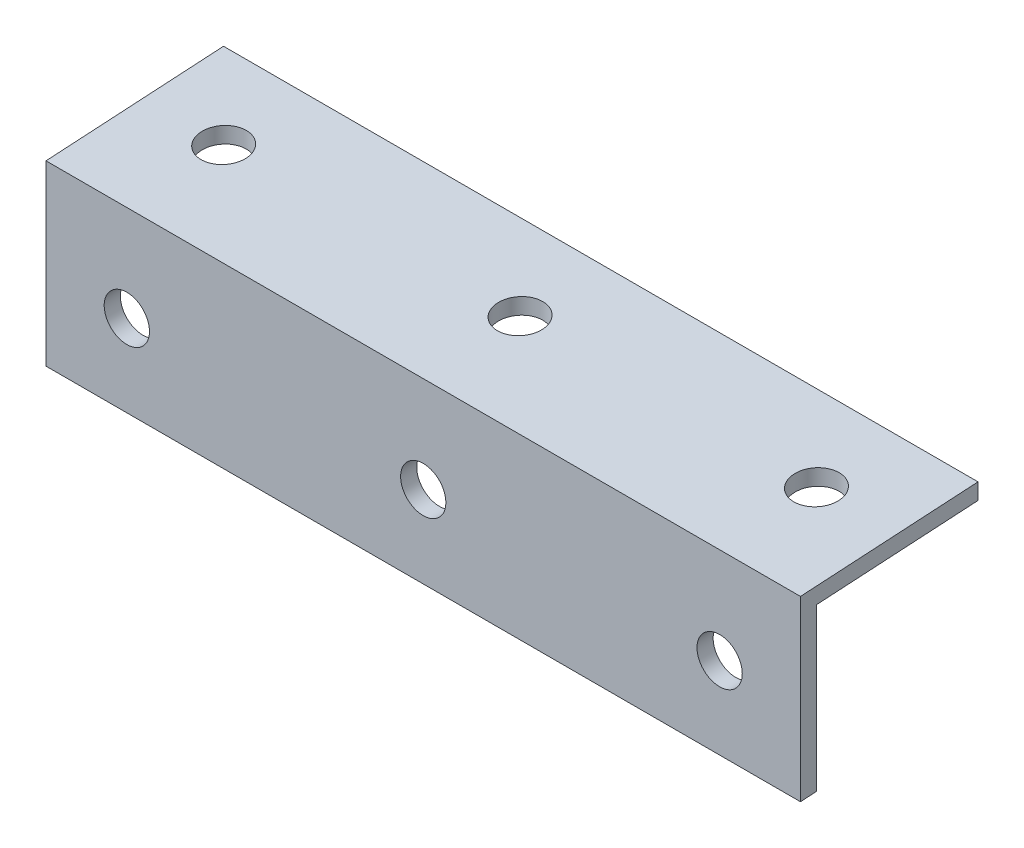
from build123d import *

# Parameters (mm, degrees)
BENT_CORNER_BRACE_DEPTH            = 88.9
TOP_FLANGE_SCREW_HOLES_DEPTH       = 93.90877935
TOP_FLANGE_SCREW_HOLES_DEPTH_BACK  = 93.90877935
SKETCH2_R                          = 2.667
SIDE_FLANGE_SCREW_HOLES_DEPTH      = 93.90877935
SIDE_FLANGE_SCREW_HOLES_DEPTH_BACK = 93.90877935
SKETCH3_R                          = 2.667


with BuildPart() as part:
    # Sketch1 → Bent_corner_brace (new body)
    with BuildSketch(Plane.YZ):
        Polygon((-19.05, 0), (0, 0), (1.120588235, -19.017012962), (3.025588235, -19.017012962), (1.792941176, 1.901701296), (-19.162058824, 1.901701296), align=None)
    extrude(amount=BENT_CORNER_BRACE_DEPTH)

    # Sketch2 → Top_flange_screw_holes (cut, two sides: drawn at the far end of the back side and taken through both)
    with BuildSketch(Plane(origin=(0, 0, 0), x_dir=(0, 1, 0), z_dir=(0, 0, 1)).offset(-TOP_FLANGE_SCREW_HOLES_DEPTH_BACK)):
        with Locations(Location((-9.525, -9.525, 0), (0, 0, 270))):
            Circle(SKETCH2_R)
        with Locations(Location((-9.525, -44.45, 0), (0, 0, 270))):
            Circle(SKETCH2_R)
        with Locations(Location((-9.525, -79.375, 0), (0, 0, 270))):
            Circle(SKETCH2_R)
    extrude(amount=TOP_FLANGE_SCREW_HOLES_DEPTH + TOP_FLANGE_SCREW_HOLES_DEPTH_BACK, mode=Mode.SUBTRACT)

    # Sketch3 → Side_flange_screw_holes (cut, two sides: drawn at the far end of the back side and taken through both)
    with BuildSketch(Plane(origin=(0, 0, 0), x_dir=(-1, 0, 0), z_dir=(0, 1, 0)).offset(-SIDE_FLANGE_SCREW_HOLES_DEPTH_BACK)):
        with Locations(Location((-9.525, -9.508506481, 0), (0, 0, 270))):
            Circle(SKETCH3_R)
        with Locations(Location((-44.45, -9.508506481, 0), (0, 0, 270))):
            Circle(SKETCH3_R)
        with Locations(Location((-79.375, -9.508506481, 0), (0, 0, 270))):
            Circle(SKETCH3_R)
    extrude(amount=SIDE_FLANGE_SCREW_HOLES_DEPTH + SIDE_FLANGE_SCREW_HOLES_DEPTH_BACK, mode=Mode.SUBTRACT)


solid = part.part
